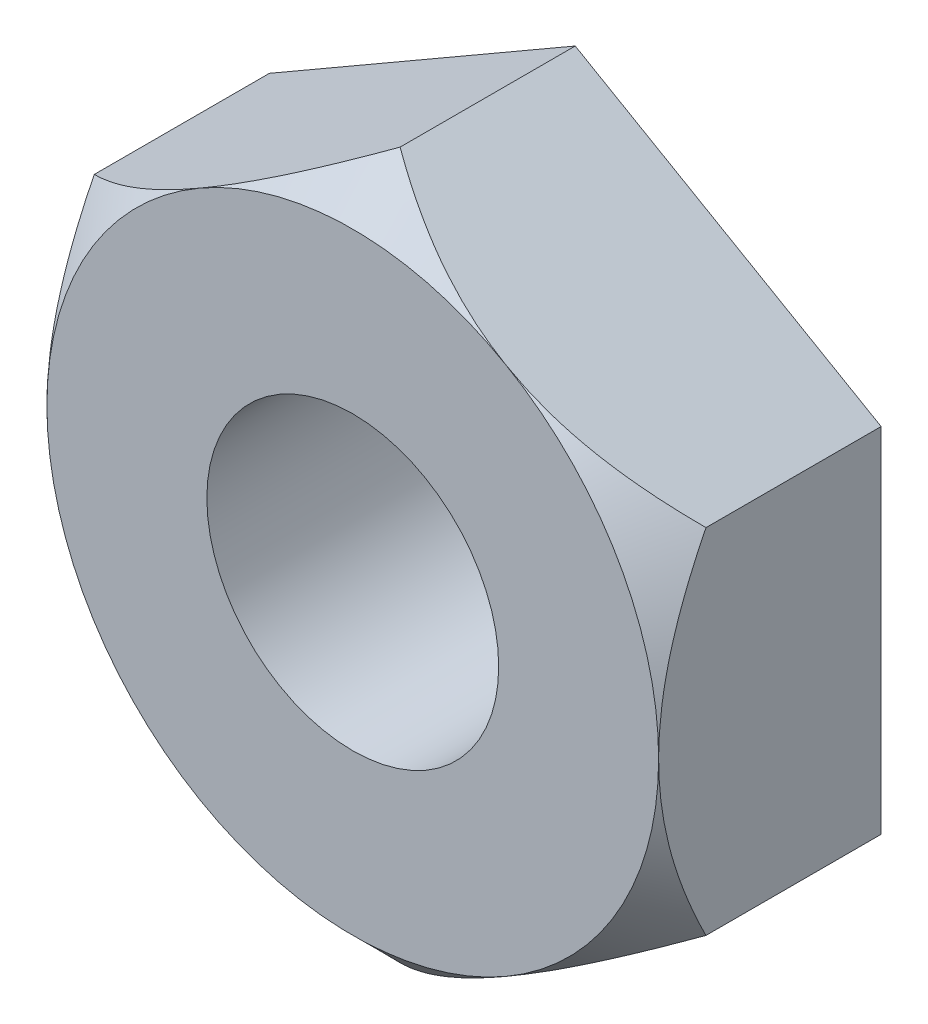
ISO-10303-21;
HEADER;
FILE_DESCRIPTION(('STEP AP214'),'2;1');
FILE_NAME('part.step','',(''),(''),'','','');
FILE_SCHEMA(('AUTOMOTIVE_DESIGN { 1 0 10303 214 1 1 1 1 }'));
ENDSEC;
DATA;
#1=APPLICATION_CONTEXT('core data for automotive mechanical design processes');
#2=APPLICATION_PROTOCOL_DEFINITION('international standard','automotive_design',2000,#1);
#3=PRODUCT_CONTEXT('',#1,'mechanical');
#4=PRODUCT('Part','Part','',(#3));
#5=PRODUCT_RELATED_PRODUCT_CATEGORY('part','',(#4));
#6=PRODUCT_DEFINITION_FORMATION('','',#4);
#7=PRODUCT_DEFINITION_CONTEXT('part definition',#1,'design');
#8=PRODUCT_DEFINITION('design','',#6,#7);
#9=PRODUCT_DEFINITION_SHAPE('','',#8);
#10=(LENGTH_UNIT() NAMED_UNIT(*) SI_UNIT(.MILLI.,.METRE.));
#11=(NAMED_UNIT(*) PLANE_ANGLE_UNIT() SI_UNIT($,.RADIAN.));
#12=(NAMED_UNIT(*) SI_UNIT($,.STERADIAN.) SOLID_ANGLE_UNIT());
#13=UNCERTAINTY_MEASURE_WITH_UNIT(LENGTH_MEASURE(1.E-05),#10,'distance_accuracy_value','');
#14=(GEOMETRIC_REPRESENTATION_CONTEXT(3) GLOBAL_UNCERTAINTY_ASSIGNED_CONTEXT((#13)) GLOBAL_UNIT_ASSIGNED_CONTEXT((#10,
#11,#12)) REPRESENTATION_CONTEXT('',''));
#15=CARTESIAN_POINT('',(0.,0.,0.));
#16=DIRECTION('',(0.,0.,1.));
#17=DIRECTION('',(1.,0.,0.));
#18=AXIS2_PLACEMENT_3D('',#15,#16,#17);
#19=CARTESIAN_POINT('',(0.,5.04098953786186,3.175));
#20=DIRECTION('',(0.,0.,1.));
#21=DIRECTION('',(1.,0.,0.));
#22=AXIS2_PLACEMENT_3D('',#19,#20,#21);
#23=PLANE('',#22);
#24=CARTESIAN_POINT('',(0.,0.,3.17500000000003));
#25=DIRECTION('',(0.,0.,1.));
#26=DIRECTION('',(1.,0.,0.));
#27=AXIS2_PLACEMENT_3D('',#24,#25,#26);
#28=CIRCLE('',#27,4.365625);
#29=CARTESIAN_POINT('',(2.18281249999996,-3.78074215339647,3.175));
#30=VERTEX_POINT('',#29);
#31=CARTESIAN_POINT('',(4.36562499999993,0.,3.175));
#32=VERTEX_POINT('',#31);
#33=EDGE_CURVE('E128',#30,#32,#28,.T.);
#34=ORIENTED_EDGE('',*,*,#33,.T.);
#35=CARTESIAN_POINT('',(2.18281249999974,3.78074215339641,3.17499999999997));
#36=VERTEX_POINT('',#35);
#37=EDGE_CURVE('E111',#32,#36,#28,.T.);
#38=ORIENTED_EDGE('',*,*,#37,.T.);
#39=CARTESIAN_POINT('',(-2.18281249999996,3.78074215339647,3.17500000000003));
#40=VERTEX_POINT('',#39);
#41=EDGE_CURVE('E102',#36,#40,#28,.T.);
#42=ORIENTED_EDGE('',*,*,#41,.T.);
#43=CARTESIAN_POINT('',(-4.36562499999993,0.,3.175));
#44=VERTEX_POINT('',#43);
#45=EDGE_CURVE('E112',#40,#44,#28,.T.);
#46=ORIENTED_EDGE('',*,*,#45,.T.);
#47=CARTESIAN_POINT('',(-2.18281249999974,-3.78074215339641,3.17500000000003));
#48=VERTEX_POINT('',#47);
#49=EDGE_CURVE('E45',#44,#48,#28,.T.);
#50=ORIENTED_EDGE('',*,*,#49,.T.);
#51=EDGE_CURVE('E53',#48,#30,#28,.T.);
#52=ORIENTED_EDGE('',*,*,#51,.T.);
#53=EDGE_LOOP('',(#34,#38,#42,#46,#50,#52));
#54=FACE_BOUND('',#53,.T.);
#55=CARTESIAN_POINT('',(0.,0.,3.17500000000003));
#56=DIRECTION('',(0.,0.,1.));
#57=DIRECTION('',(1.,0.,0.));
#58=AXIS2_PLACEMENT_3D('',#55,#56,#57);
#59=CIRCLE('',#58,2.0828);
#60=CARTESIAN_POINT('',(2.0828,0.,3.17500000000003));
#61=VERTEX_POINT('',#60);
#62=EDGE_CURVE('E228',#61,#61,#59,.T.);
#63=ORIENTED_EDGE('',*,*,#62,.F.);
#64=EDGE_LOOP('',(#63));
#65=FACE_BOUND('',#64,.T.);
#66=ADVANCED_FACE('F24',(#54,#65),#23,.T.);
#67=CARTESIAN_POINT('',(0.,5.04098953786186,0.));
#68=DIRECTION('',(0.,0.,1.));
#69=DIRECTION('',(1.,0.,0.));
#70=AXIS2_PLACEMENT_3D('',#67,#68,#69);
#71=PLANE('',#70);
#72=DIRECTION('',(-0.866025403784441,-0.500000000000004,0.));
#73=VECTOR('',#72,1.);
#74=CARTESIAN_POINT('',(0.,5.04098953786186,0.));
#75=LINE('',#74,#73);
#76=CARTESIAN_POINT('',(0.,5.04098953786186,0.));
#77=VERTEX_POINT('',#76);
#78=CARTESIAN_POINT('',(-4.36562500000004,2.5204947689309,0.));
#79=VERTEX_POINT('',#78);
#80=EDGE_CURVE('E223',#77,#79,#75,.T.);
#81=ORIENTED_EDGE('',*,*,#80,.F.);
#82=DIRECTION('',(0.866025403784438,-0.5,0.));
#83=VECTOR('',#82,1.);
#84=CARTESIAN_POINT('',(0.,5.04098953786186,0.));
#85=LINE('',#84,#83);
#86=CARTESIAN_POINT('',(4.36562500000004,2.52049476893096,0.));
#87=VERTEX_POINT('',#86);
#88=EDGE_CURVE('E209',#77,#87,#85,.T.);
#89=ORIENTED_EDGE('',*,*,#88,.T.);
#90=DIRECTION('',(0.,-1.,0.));
#91=VECTOR('',#90,1.);
#92=CARTESIAN_POINT('',(4.36562500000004,2.52049476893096,0.));
#93=LINE('',#92,#91);
#94=CARTESIAN_POINT('',(4.36562499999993,-2.52049476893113,0.));
#95=VERTEX_POINT('',#94);
#96=EDGE_CURVE('E204',#87,#95,#93,.T.);
#97=ORIENTED_EDGE('',*,*,#96,.T.);
#98=DIRECTION('',(0.866025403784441,0.500000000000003,0.));
#99=VECTOR('',#98,1.);
#100=CARTESIAN_POINT('',(0.,-5.04098953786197,0.));
#101=LINE('',#100,#99);
#102=CARTESIAN_POINT('',(0.,-5.04098953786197,0.));
#103=VERTEX_POINT('',#102);
#104=EDGE_CURVE('E233',#103,#95,#101,.T.);
#105=ORIENTED_EDGE('',*,*,#104,.F.);
#106=DIRECTION('',(-0.866025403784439,0.5,0.));
#107=VECTOR('',#106,1.);
#108=CARTESIAN_POINT('',(0.,-5.04098953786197,0.));
#109=LINE('',#108,#107);
#110=CARTESIAN_POINT('',(-4.36562500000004,-2.52049476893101,0.));
#111=VERTEX_POINT('',#110);
#112=EDGE_CURVE('E226',#103,#111,#109,.T.);
#113=ORIENTED_EDGE('',*,*,#112,.T.);
#114=DIRECTION('',(0.,-1.,0.));
#115=VECTOR('',#114,1.);
#116=CARTESIAN_POINT('',(-4.36562500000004,2.5204947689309,0.));
#117=LINE('',#116,#115);
#118=EDGE_CURVE('E215',#79,#111,#117,.T.);
#119=ORIENTED_EDGE('',*,*,#118,.F.);
#120=EDGE_LOOP('',(#81,#89,#97,#105,#113,#119));
#121=FACE_BOUND('',#120,.T.);
#122=CARTESIAN_POINT('',(0.,0.,0.));
#123=DIRECTION('',(0.,0.,1.));
#124=DIRECTION('',(1.,0.,0.));
#125=AXIS2_PLACEMENT_3D('',#122,#123,#124);
#126=CIRCLE('',#125,2.0828);
#127=CARTESIAN_POINT('',(2.0828,0.,0.));
#128=VERTEX_POINT('',#127);
#129=EDGE_CURVE('E139',#128,#128,#126,.T.);
#130=ORIENTED_EDGE('',*,*,#129,.T.);
#131=EDGE_LOOP('',(#130));
#132=FACE_BOUND('',#131,.T.);
#133=ADVANCED_FACE('F221',(#121,#132),#71,.F.);
#134=CARTESIAN_POINT('',(0.,5.04098953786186,3.175));
#135=DIRECTION('',(0.5,-0.86602540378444,0.));
#136=DIRECTION('',(0.866025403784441,0.500000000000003,0.));
#137=AXIS2_PLACEMENT_3D('',#134,#135,#136);
#138=PLANE('',#137);
#139=CARTESIAN_POINT('',(0.000200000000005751,5.0411050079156,2.49951998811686));
#140=CARTESIAN_POINT('',(-0.0748657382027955,4.99776578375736,2.54285568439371));
#141=CARTESIAN_POINT('',(-0.150508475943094,4.95409342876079,2.58486150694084));
#142=CARTESIAN_POINT('',(-0.303061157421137,4.86601709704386,2.66580884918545));
#143=CARTESIAN_POINT('',(-0.379971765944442,4.82161273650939,2.704748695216));
#144=CARTESIAN_POINT('',(-0.613489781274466,4.68679104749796,2.81669452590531));
#145=CARTESIAN_POINT('',(-0.772074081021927,4.59523235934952,2.88434920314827));
#146=CARTESIAN_POINT('',(-1.09187204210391,4.41059692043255,3.00020333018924));
#147=CARTESIAN_POINT('',(-1.2530039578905,4.31756736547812,3.04869466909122));
#148=CARTESIAN_POINT('',(-1.49735101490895,4.17649352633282,3.10478734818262));
#149=CARTESIAN_POINT('',(-1.5791597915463,4.12926120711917,3.12070335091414));
#150=CARTESIAN_POINT('',(-1.74347006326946,4.03439662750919,3.14662706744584));
#151=CARTESIAN_POINT('',(-1.82597145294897,3.98676442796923,3.1566356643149));
#152=CARTESIAN_POINT('',(-2.02701302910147,3.87069301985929,3.17341632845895));
#153=CARTESIAN_POINT('',(-2.14576982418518,3.80212875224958,3.17693743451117));
#154=CARTESIAN_POINT('',(-2.38306940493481,3.66512377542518,3.17102881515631));
#155=CARTESIAN_POINT('',(-2.50161210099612,3.59668311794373,3.1615945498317));
#156=CARTESIAN_POINT('',(-2.73757992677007,3.46044703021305,3.13033130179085));
#157=CARTESIAN_POINT('',(-2.85500365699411,3.39265240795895,3.10848845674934));
#158=CARTESIAN_POINT('',(-3.08783290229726,3.25822838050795,3.05359557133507));
#159=CARTESIAN_POINT('',(-3.20323857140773,3.19159888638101,3.02054639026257));
#160=CARTESIAN_POINT('',(-3.40811000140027,3.07331631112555,2.95255207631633));
#161=CARTESIAN_POINT('',(-3.49802929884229,3.02140138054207,2.91939475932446));
#162=CARTESIAN_POINT('',(-3.6762536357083,2.91850351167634,2.84773661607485));
#163=CARTESIAN_POINT('',(-3.76455862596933,2.86752060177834,2.80923562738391));
#164=CARTESIAN_POINT('',(-3.9392762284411,2.7666473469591,2.7277532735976));
#165=CARTESIAN_POINT('',(-4.02569380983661,2.71675413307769,2.68478599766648));
#166=CARTESIAN_POINT('',(-4.1969286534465,2.61789165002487,2.59493525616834));
#167=CARTESIAN_POINT('',(-4.28174685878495,2.56892183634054,2.54805419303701));
#168=CARTESIAN_POINT('',(-4.36582499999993,2.52037929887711,2.49951998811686));
#169=B_SPLINE_CURVE_WITH_KNOTS('',3,(#139,#140,#141,#142,#143,#144,#145,#146,#147,#148,#149,
#150,#151,#152,#153,#154,#155,#156,#157,#158,#159,#160,#161,#162,#163,#164,#165,#166,#167,#168),
.UNSPECIFIED.,.F.,.F.,(4,2,2,2,2,2,2,2,2,2,2,2,2,2,4),(0.,0.290706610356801,0.58157082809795,
1.16643976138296,1.74202094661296,2.02924700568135,2.31643011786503,2.72731191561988,
3.13833773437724,3.54982363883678,3.96127799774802,4.28811145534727,4.61495484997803,
4.9407968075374,5.26644020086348),.UNSPECIFIED.);
#170=CARTESIAN_POINT('',(0.,5.04098953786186,2.49963546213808));
#171=VERTEX_POINT('',#170);
#172=EDGE_CURVE('E106',#171,#40,#169,.T.);
#173=ORIENTED_EDGE('',*,*,#172,.F.);
#174=DIRECTION('',(0.,0.,-1.));
#175=VECTOR('',#174,1.);
#176=CARTESIAN_POINT('',(0.,5.04098953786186,3.175));
#177=LINE('',#176,#175);
#178=EDGE_CURVE('E126',#171,#77,#177,.T.);
#179=ORIENTED_EDGE('',*,*,#178,.T.);
#180=ORIENTED_EDGE('',*,*,#80,.T.);
#181=DIRECTION('',(0.,0.,-1.));
#182=VECTOR('',#181,1.);
#183=CARTESIAN_POINT('',(-4.36562500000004,2.5204947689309,3.175));
#184=LINE('',#183,#182);
#185=CARTESIAN_POINT('',(-4.36562500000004,2.5204947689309,2.49963546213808));
#186=VERTEX_POINT('',#185);
#187=EDGE_CURVE('E122',#186,#79,#184,.T.);
#188=ORIENTED_EDGE('',*,*,#187,.F.);
#189=EDGE_CURVE('E133',#40,#186,#169,.T.);
#190=ORIENTED_EDGE('',*,*,#189,.F.);
#191=EDGE_LOOP('',(#173,#179,#180,#188,#190));
#192=FACE_BOUND('',#191,.T.);
#193=ADVANCED_FACE('F26',(#192),#138,.F.);
#194=CARTESIAN_POINT('',(-4.36562500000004,2.5204947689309,3.175));
#195=DIRECTION('',(1.,0.,0.));
#196=DIRECTION('',(0.,1.,0.));
#197=AXIS2_PLACEMENT_3D('',#194,#195,#196);
#198=PLANE('',#197);
#199=CARTESIAN_POINT('',(-4.36562500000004,-6.45523378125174,-0.252238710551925));
#200=CARTESIAN_POINT('',(-4.36562500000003,-6.29278793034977,-0.117710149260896));
#201=CARTESIAN_POINT('',(-4.36562500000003,-6.12958412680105,0.015917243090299));
#202=CARTESIAN_POINT('',(-4.36562500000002,-5.80126519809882,0.280885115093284));
#203=CARTESIAN_POINT('',(-4.36562500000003,-5.63614960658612,0.412225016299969));
#204=CARTESIAN_POINT('',(-4.36562500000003,-5.30184889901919,0.673506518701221));
#205=CARTESIAN_POINT('',(-4.36562500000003,-5.13263895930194,0.803416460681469));
#206=CARTESIAN_POINT('',(-4.36562500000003,-4.79147665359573,1.05955841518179));
#207=CARTESIAN_POINT('',(-4.36562500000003,-4.61952456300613,1.18579079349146));
#208=CARTESIAN_POINT('',(-4.36562500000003,-4.25495675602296,1.44592135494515));
#209=CARTESIAN_POINT('',(-4.36562500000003,-4.06198957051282,1.5793297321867));
#210=CARTESIAN_POINT('',(-4.36562500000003,-3.67092314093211,1.83861603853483));
#211=CARTESIAN_POINT('',(-4.36562500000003,-3.4728221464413,1.96449134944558));
#212=CARTESIAN_POINT('',(-4.36562500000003,-3.07128678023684,2.20529276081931));
#213=CARTESIAN_POINT('',(-4.36562500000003,-2.86788198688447,2.32026772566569));
#214=CARTESIAN_POINT('',(-4.36562500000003,-2.45366201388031,2.53583889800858));
#215=CARTESIAN_POINT('',(-4.36562500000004,-2.24285377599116,2.63644814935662));
#216=CARTESIAN_POINT('',(-4.36562500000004,-1.87793051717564,2.79016332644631));
#217=CARTESIAN_POINT('',(-4.36562500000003,-1.72600254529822,2.84842383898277));
#218=CARTESIAN_POINT('',(-4.36562500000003,-1.41793250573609,2.9527909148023));
#219=CARTESIAN_POINT('',(-4.36562500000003,-1.26178987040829,2.99889583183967));
#220=CARTESIAN_POINT('',(-4.36562500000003,-0.949462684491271,3.07544845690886));
#221=CARTESIAN_POINT('',(-4.36562500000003,-0.793362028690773,3.10623251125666));
#222=CARTESIAN_POINT('',(-4.36562500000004,-0.47880551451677,3.15157503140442));
#223=CARTESIAN_POINT('',(-4.36562500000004,-0.320350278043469,3.16613770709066));
#224=CARTESIAN_POINT('',(-4.36562500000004,-0.0118154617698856,3.17755082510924));
#225=CARTESIAN_POINT('',(-4.36562500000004,0.138228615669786,3.17536038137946));
#226=CARTESIAN_POINT('',(-4.36562500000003,0.437301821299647,3.15569180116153));
#227=CARTESIAN_POINT('',(-4.36562500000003,0.586330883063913,3.13821267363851));
#228=CARTESIAN_POINT('',(-4.36562500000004,0.884907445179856,3.08870168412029));
#229=CARTESIAN_POINT('',(-4.36562500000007,1.03440793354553,3.05639150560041));
#230=CARTESIAN_POINT('',(-4.36562500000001,1.33004425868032,2.97912133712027));
#231=CARTESIAN_POINT('',(-4.36562499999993,1.47618010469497,2.93416138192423));
#232=CARTESIAN_POINT('',(-4.36562499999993,1.76651347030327,2.83313215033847));
#233=CARTESIAN_POINT('',(-4.36562500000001,1.91066549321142,2.77693385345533));
#234=CARTESIAN_POINT('',(-4.36562500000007,2.19528951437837,2.65581403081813));
#235=CARTESIAN_POINT('',(-4.36562500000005,2.33575988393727,2.59088871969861));
#236=CARTESIAN_POINT('',(-4.36562500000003,2.61366128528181,2.45385310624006));
#237=CARTESIAN_POINT('',(-4.36562500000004,2.75108160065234,2.38172125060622));
#238=CARTESIAN_POINT('',(-4.36562500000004,3.02278423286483,2.2318521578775));
#239=CARTESIAN_POINT('',(-4.36562500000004,3.15706701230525,2.15411575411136));
#240=CARTESIAN_POINT('',(-4.36562500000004,3.41632658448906,1.99808113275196));
#241=CARTESIAN_POINT('',(-4.36562500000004,3.54143519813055,1.92000078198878));
#242=CARTESIAN_POINT('',(-4.36562500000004,3.78950266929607,1.76048711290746));
#243=CARTESIAN_POINT('',(-4.36562500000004,3.91246136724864,1.67905354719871));
#244=CARTESIAN_POINT('',(-4.36562500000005,4.1555325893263,1.51408252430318));
#245=CARTESIAN_POINT('',(-4.36562500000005,4.27565994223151,1.43056683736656));
#246=CARTESIAN_POINT('',(-4.36562500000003,4.51426249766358,1.26127385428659));
#247=CARTESIAN_POINT('',(-4.365625,4.63273814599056,1.17549718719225));
#248=CARTESIAN_POINT('',(-4.36562499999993,4.75051992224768,1.08879416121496));
#249=B_SPLINE_CURVE_WITH_KNOTS('',3,(#199,#200,#201,#202,#203,#204,#205,#206,#207,#208,#209,
#210,#211,#212,#213,#214,#215,#216,#217,#218,#219,#220,#221,#222,#223,#224,#225,#226,#227,#228,
#229,#230,#231,#232,#233,#234,#235,#236,#237,#238,#239,#240,#241,#242,#243,#244,#245,#246,#247,
#248),.UNSPECIFIED.,.F.,.F.,(4,2,2,2,2,2,2,2,2,2,2,2,2,2,2,2,2,2,2,2,2,2,2,2,4),(0.,
0.632765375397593,1.26568850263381,1.90563057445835,2.54550877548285,3.24915816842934,
3.95305071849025,4.65362173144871,5.35355253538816,5.84129599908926,6.32910548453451,
6.80567300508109,7.28211681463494,7.73149737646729,8.18090706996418,8.63911863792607,
9.09732894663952,9.5611375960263,10.0251480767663,10.4905904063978,10.9559636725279,
11.3983244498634,11.8407179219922,12.2796077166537,12.7183766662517),.UNSPECIFIED.);
#250=EDGE_CURVE('E135',#186,#44,#249,.F.);
#251=ORIENTED_EDGE('',*,*,#250,.F.);
#252=ORIENTED_EDGE('',*,*,#187,.T.);
#253=ORIENTED_EDGE('',*,*,#118,.T.);
#254=DIRECTION('',(0.,0.,-1.));
#255=VECTOR('',#254,1.);
#256=CARTESIAN_POINT('',(-4.36562500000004,-2.52049476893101,3.175));
#257=LINE('',#256,#255);
#258=CARTESIAN_POINT('',(-4.36562500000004,-2.52049476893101,2.49963546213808));
#259=VERTEX_POINT('',#258);
#260=EDGE_CURVE('E145',#259,#111,#257,.T.);
#261=ORIENTED_EDGE('',*,*,#260,.F.);
#262=EDGE_CURVE('E140',#44,#259,#249,.F.);
#263=ORIENTED_EDGE('',*,*,#262,.F.);
#264=EDGE_LOOP('',(#251,#252,#253,#261,#263));
#265=FACE_BOUND('',#264,.T.);
#266=ADVANCED_FACE('F143',(#265),#198,.F.);
#267=CARTESIAN_POINT('',(0.,-5.04098953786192,3.175));
#268=DIRECTION('',(-0.500000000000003,-0.866025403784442,0.));
#269=DIRECTION('',(0.866025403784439,-0.5,0.));
#270=AXIS2_PLACEMENT_3D('',#267,#268,#269);
#271=PLANE('',#270);
#272=DIRECTION('',(0.,0.,-1.));
#273=VECTOR('',#272,1.);
#274=CARTESIAN_POINT('',(0.,-5.04098953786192,3.175));
#275=LINE('',#274,#273);
#276=CARTESIAN_POINT('',(0.,-5.04098953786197,2.49963546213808));
#277=VERTEX_POINT('',#276);
#278=EDGE_CURVE('E207',#277,#103,#275,.T.);
#279=ORIENTED_EDGE('',*,*,#278,.F.);
#280=CARTESIAN_POINT('',(0.000200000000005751,-5.04110500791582,2.49951998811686));
#281=CARTESIAN_POINT('',(-0.074865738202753,-4.9977657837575,2.54285568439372));
#282=CARTESIAN_POINT('',(-0.150508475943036,-4.95409342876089,2.58486150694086));
#283=CARTESIAN_POINT('',(-0.303061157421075,-4.86601709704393,2.66580884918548));
#284=CARTESIAN_POINT('',(-0.379971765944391,-4.82161273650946,2.70474869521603));
#285=CARTESIAN_POINT('',(-0.613489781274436,-4.68679104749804,2.81669452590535));
#286=CARTESIAN_POINT('',(-0.772074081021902,-4.59523235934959,2.88434920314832));
#287=CARTESIAN_POINT('',(-1.09187204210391,-4.4105969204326,3.00020333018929));
#288=CARTESIAN_POINT('',(-1.25300395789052,-4.31756736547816,3.04869466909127));
#289=CARTESIAN_POINT('',(-1.497351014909,-4.17649352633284,3.10478734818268));
#290=CARTESIAN_POINT('',(-1.57915979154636,-4.12926120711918,3.12070335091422));
#291=CARTESIAN_POINT('',(-1.74347006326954,-4.0343966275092,3.14662706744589));
#292=CARTESIAN_POINT('',(-1.82597145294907,-3.98676442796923,3.15663566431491));
#293=CARTESIAN_POINT('',(-2.0270130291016,-3.87069301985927,3.17341632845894));
#294=CARTESIAN_POINT('',(-2.14576982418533,-3.80212875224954,3.1769374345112));
#295=CARTESIAN_POINT('',(-2.38306940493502,-3.66512377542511,3.17102881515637));
#296=CARTESIAN_POINT('',(-2.50161210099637,-3.59668311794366,3.16159454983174));
#297=CARTESIAN_POINT('',(-2.73757992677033,-3.46044703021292,3.13033130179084));
#298=CARTESIAN_POINT('',(-2.85500365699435,-3.39265240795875,3.1084884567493));
#299=CARTESIAN_POINT('',(-3.08783290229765,-3.25822838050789,3.05359557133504));
#300=CARTESIAN_POINT('',(-3.20323857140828,-3.19159888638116,3.02054639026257));
#301=CARTESIAN_POINT('',(-3.40811000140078,-3.07331631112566,2.9525520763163));
#302=CARTESIAN_POINT('',(-3.49802929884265,-3.02140138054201,2.91939475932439));
#303=CARTESIAN_POINT('',(-3.6762536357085,-2.91850351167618,2.84773661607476));
#304=CARTESIAN_POINT('',(-3.76455862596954,-2.86752060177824,2.80923562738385));
#305=CARTESIAN_POINT('',(-3.93927622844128,-2.76664734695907,2.72775327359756));
#306=CARTESIAN_POINT('',(-4.02569380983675,-2.71675413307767,2.68478599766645));
#307=CARTESIAN_POINT('',(-4.19692865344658,-2.61789165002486,2.59493525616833));
#308=CARTESIAN_POINT('',(-4.28174685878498,-2.56892183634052,2.54805419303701));
#309=CARTESIAN_POINT('',(-4.36582499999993,-2.52037929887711,2.49951998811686));
#310=B_SPLINE_CURVE_WITH_KNOTS('',3,(#280,#281,#282,#283,#284,#285,#286,#287,#288,#289,#290,
#291,#292,#293,#294,#295,#296,#297,#298,#299,#300,#301,#302,#303,#304,#305,#306,#307,#308,#309),
.UNSPECIFIED.,.F.,.F.,(4,2,2,2,2,2,2,2,2,2,2,2,2,2,4),(0.,0.290706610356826,0.581570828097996,
1.16643976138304,1.7420209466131,2.02924700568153,2.31643011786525,2.72731191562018,
3.13833773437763,3.54982363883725,3.96127799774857,4.28811145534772,4.61495484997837,
4.94079680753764,5.26644020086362),.UNSPECIFIED.);
#311=EDGE_CURVE('E149',#277,#48,#310,.T.);
#312=ORIENTED_EDGE('',*,*,#311,.T.);
#313=EDGE_CURVE('E147',#48,#259,#310,.T.);
#314=ORIENTED_EDGE('',*,*,#313,.T.);
#315=ORIENTED_EDGE('',*,*,#260,.T.);
#316=ORIENTED_EDGE('',*,*,#112,.F.);
#317=EDGE_LOOP('',(#279,#312,#314,#315,#316));
#318=FACE_BOUND('',#317,.T.);
#319=ADVANCED_FACE('F164',(#318),#271,.T.);
#320=CARTESIAN_POINT('',(0.,-5.04098953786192,3.175));
#321=DIRECTION('',(-0.5,0.86602540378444,0.));
#322=DIRECTION('',(-0.866025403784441,-0.500000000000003,0.));
#323=AXIS2_PLACEMENT_3D('',#320,#321,#322);
#324=PLANE('',#323);
#325=CARTESIAN_POINT('',(-0.000200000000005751,-5.04110500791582,2.49951998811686));
#326=CARTESIAN_POINT('',(0.0748657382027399,-4.99776578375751,2.54285568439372));
#327=CARTESIAN_POINT('',(0.150508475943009,-4.95409342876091,2.58486150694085));
#328=CARTESIAN_POINT('',(0.30306115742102,-4.86601709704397,2.66580884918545));
#329=CARTESIAN_POINT('',(0.379971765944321,-4.8216127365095,2.70474869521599));
#330=CARTESIAN_POINT('',(0.61348978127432,-4.68679104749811,2.8166945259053));
#331=CARTESIAN_POINT('',(0.772074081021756,-4.59523235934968,2.88434920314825));
#332=CARTESIAN_POINT('',(1.09187204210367,-4.41059692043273,3.00020333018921));
#333=CARTESIAN_POINT('',(1.25300395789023,-4.3175673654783,3.04869466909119));
#334=CARTESIAN_POINT('',(1.49735101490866,-4.17649352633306,3.10478734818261));
#335=CARTESIAN_POINT('',(1.57915979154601,-4.12926120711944,3.12070335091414));
#336=CARTESIAN_POINT('',(1.74347006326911,-4.03439662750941,3.14662706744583));
#337=CARTESIAN_POINT('',(1.82597145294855,-3.98676442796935,3.15663566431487));
#338=CARTESIAN_POINT('',(2.02701302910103,-3.87069301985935,3.17341632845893));
#339=CARTESIAN_POINT('',(2.14576982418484,-3.80212875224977,3.1769374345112));
#340=CARTESIAN_POINT('',(2.38306940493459,-3.66512377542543,3.17102881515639));
#341=CARTESIAN_POINT('',(2.5016121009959,-3.59668311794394,3.16159454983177));
#342=CARTESIAN_POINT('',(2.73757992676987,-3.46044703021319,3.13033130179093));
#343=CARTESIAN_POINT('',(2.85500365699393,-3.39265240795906,3.10848845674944));
#344=CARTESIAN_POINT('',(3.08783290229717,-3.25822838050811,3.0535955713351));
#345=CARTESIAN_POINT('',(3.2032385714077,-3.19159888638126,3.02054639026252));
#346=CARTESIAN_POINT('',(3.40811000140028,-3.07331631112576,2.95255207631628));
#347=CARTESIAN_POINT('',(3.49802929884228,-3.02140138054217,2.91939475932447));
#348=CARTESIAN_POINT('',(3.67625363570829,-2.91850351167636,2.8477366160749));
#349=CARTESIAN_POINT('',(3.76455862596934,-2.86752060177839,2.80923562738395));
#350=CARTESIAN_POINT('',(3.93927622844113,-2.76664734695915,2.72775327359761));
#351=CARTESIAN_POINT('',(4.02569380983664,-2.71675413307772,2.68478599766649));
#352=CARTESIAN_POINT('',(4.19692865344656,-2.61789165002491,2.59493525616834));
#353=CARTESIAN_POINT('',(4.28174685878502,-2.56892183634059,2.54805419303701));
#354=CARTESIAN_POINT('',(4.36582500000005,-2.52037929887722,2.49951998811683));
#355=B_SPLINE_CURVE_WITH_KNOTS('',3,(#325,#326,#327,#328,#329,#330,#331,#332,#333,#334,#335,
#336,#337,#338,#339,#340,#341,#342,#343,#344,#345,#346,#347,#348,#349,#350,#351,#352,#353,#354),
.UNSPECIFIED.,.F.,.F.,(4,2,2,2,2,2,2,2,2,2,2,2,2,2,4),(0.,0.290706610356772,0.58157082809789,
1.16643976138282,1.74202094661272,2.02924700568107,2.31643011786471,2.72731191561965,
3.13833773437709,3.54982363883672,3.96127799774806,4.28811145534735,4.61495484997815,
4.94079680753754,5.26644020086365),.UNSPECIFIED.);
#356=EDGE_CURVE('E181',#277,#30,#355,.T.);
#357=ORIENTED_EDGE('',*,*,#356,.F.);
#358=ORIENTED_EDGE('',*,*,#278,.T.);
#359=ORIENTED_EDGE('',*,*,#104,.T.);
#360=DIRECTION('',(0.,0.,-1.));
#361=VECTOR('',#360,1.);
#362=CARTESIAN_POINT('',(4.36562500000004,-2.52049476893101,3.17499999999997));
#363=LINE('',#362,#361);
#364=CARTESIAN_POINT('',(4.36562500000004,-2.52049476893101,2.49963546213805));
#365=VERTEX_POINT('',#364);
#366=EDGE_CURVE('E196',#365,#95,#363,.T.);
#367=ORIENTED_EDGE('',*,*,#366,.F.);
#368=EDGE_CURVE('E176',#30,#365,#355,.T.);
#369=ORIENTED_EDGE('',*,*,#368,.F.);
#370=EDGE_LOOP('',(#357,#358,#359,#367,#369));
#371=FACE_BOUND('',#370,.T.);
#372=ADVANCED_FACE('F168',(#371),#324,.F.);
#373=CARTESIAN_POINT('',(4.36562500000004,2.52049476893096,3.175));
#374=DIRECTION('',(1.,0.,0.));
#375=DIRECTION('',(0.,1.,0.));
#376=AXIS2_PLACEMENT_3D('',#373,#374,#375);
#377=PLANE('',#376);
#378=DIRECTION('',(0.,0.,-1.));
#379=VECTOR('',#378,1.);
#380=CARTESIAN_POINT('',(4.36562500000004,2.52049476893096,3.175));
#381=LINE('',#380,#379);
#382=CARTESIAN_POINT('',(4.36562500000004,2.52049476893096,2.49963546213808));
#383=VERTEX_POINT('',#382);
#384=EDGE_CURVE('E202',#383,#87,#381,.T.);
#385=ORIENTED_EDGE('',*,*,#384,.F.);
#386=CARTESIAN_POINT('',(4.36562500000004,-6.4552337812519,-0.252238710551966));
#387=CARTESIAN_POINT('',(4.36562500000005,-6.2927879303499,-0.11771014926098));
#388=CARTESIAN_POINT('',(4.36562500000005,-6.12958412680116,0.0159172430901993));
#389=CARTESIAN_POINT('',(4.36562500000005,-5.80126519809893,0.280885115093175));
#390=CARTESIAN_POINT('',(4.36562500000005,-5.63614960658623,0.412225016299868));
#391=CARTESIAN_POINT('',(4.36562500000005,-5.3018488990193,0.673506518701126));
#392=CARTESIAN_POINT('',(4.36562500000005,-5.13263895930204,0.803416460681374));
#393=CARTESIAN_POINT('',(4.36562500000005,-4.79147665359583,1.0595584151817));
#394=CARTESIAN_POINT('',(4.36562500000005,-4.61952456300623,1.18579079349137));
#395=CARTESIAN_POINT('',(4.36562500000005,-4.25495675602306,1.44592135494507));
#396=CARTESIAN_POINT('',(4.36562500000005,-4.06198957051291,1.57932973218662));
#397=CARTESIAN_POINT('',(4.36562500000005,-3.67092314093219,1.83861603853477));
#398=CARTESIAN_POINT('',(4.36562500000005,-3.47282214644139,1.96449134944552));
#399=CARTESIAN_POINT('',(4.36562500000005,-3.07128678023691,2.20529276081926));
#400=CARTESIAN_POINT('',(4.36562500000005,-2.86788198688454,2.32026772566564));
#401=CARTESIAN_POINT('',(4.36562500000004,-2.45366201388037,2.53583889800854));
#402=CARTESIAN_POINT('',(4.36562500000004,-2.24285377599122,2.63644814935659));
#403=CARTESIAN_POINT('',(4.36562500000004,-1.87793051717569,2.79016332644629));
#404=CARTESIAN_POINT('',(4.36562500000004,-1.72600254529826,2.84842383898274));
#405=CARTESIAN_POINT('',(4.36562500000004,-1.41793250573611,2.95279091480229));
#406=CARTESIAN_POINT('',(4.36562500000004,-1.2617898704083,2.99889583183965));
#407=CARTESIAN_POINT('',(4.36562500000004,-0.949462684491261,3.07544845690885));
#408=CARTESIAN_POINT('',(4.36562500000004,-0.793362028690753,3.10623251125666));
#409=CARTESIAN_POINT('',(4.36562500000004,-0.478805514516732,3.15157503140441));
#410=CARTESIAN_POINT('',(4.36562500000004,-0.320350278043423,3.16613770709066));
#411=CARTESIAN_POINT('',(4.36562500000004,-0.0118154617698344,3.17755082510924));
#412=CARTESIAN_POINT('',(4.36562500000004,0.138228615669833,3.17536038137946));
#413=CARTESIAN_POINT('',(4.36562500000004,0.437301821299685,3.15569180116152));
#414=CARTESIAN_POINT('',(4.36562500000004,0.586330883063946,3.1382126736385));
#415=CARTESIAN_POINT('',(4.36562500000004,0.884907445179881,3.08870168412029));
#416=CARTESIAN_POINT('',(4.36562500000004,1.03440793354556,3.05639150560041));
#417=CARTESIAN_POINT('',(4.36562500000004,1.33004425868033,2.97912133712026));
#418=CARTESIAN_POINT('',(4.36562500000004,1.47618010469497,2.9341613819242));
#419=CARTESIAN_POINT('',(4.36562500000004,1.76651347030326,2.83313215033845));
#420=CARTESIAN_POINT('',(4.36562500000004,1.91066549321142,2.77693385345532));
#421=CARTESIAN_POINT('',(4.36562500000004,2.19528951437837,2.65581403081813));
#422=CARTESIAN_POINT('',(4.36562500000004,2.33575988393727,2.59088871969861));
#423=CARTESIAN_POINT('',(4.36562500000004,2.6136612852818,2.45385310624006));
#424=CARTESIAN_POINT('',(4.36562500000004,2.75108160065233,2.38172125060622));
#425=CARTESIAN_POINT('',(4.36562500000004,3.02278423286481,2.23185215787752));
#426=CARTESIAN_POINT('',(4.36562500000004,3.15706701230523,2.15411575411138));
#427=CARTESIAN_POINT('',(4.36562500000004,3.41632658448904,1.99808113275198));
#428=CARTESIAN_POINT('',(4.36562500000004,3.54143519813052,1.9200007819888));
#429=CARTESIAN_POINT('',(4.36562500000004,3.78950266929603,1.76048711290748));
#430=CARTESIAN_POINT('',(4.36562500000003,3.9124613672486,1.67905354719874));
#431=CARTESIAN_POINT('',(4.36562500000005,4.15553258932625,1.51408252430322));
#432=CARTESIAN_POINT('',(4.36562500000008,4.27565994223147,1.43056683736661));
#433=CARTESIAN_POINT('',(4.365625,4.51426249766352,1.26127385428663));
#434=CARTESIAN_POINT('',(4.36562499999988,4.63273814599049,1.17549718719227));
#435=CARTESIAN_POINT('',(4.3656249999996,4.75051992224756,1.08879416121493));
#436=B_SPLINE_CURVE_WITH_KNOTS('',3,(#386,#387,#388,#389,#390,#391,#392,#393,#394,#395,#396,
#397,#398,#399,#400,#401,#402,#403,#404,#405,#406,#407,#408,#409,#410,#411,#412,#413,#414,#415,
#416,#417,#418,#419,#420,#421,#422,#423,#424,#425,#426,#427,#428,#429,#430,#431,#432,#433,#434,
#435),.UNSPECIFIED.,.F.,.F.,(4,2,2,2,2,2,2,2,2,2,2,2,2,2,2,2,2,2,2,2,2,2,2,2,4),(0.,
0.632765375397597,1.26568850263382,1.90563057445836,2.54550877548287,3.24915816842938,
3.95305071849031,4.65362173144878,5.35355253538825,5.84129599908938,6.32910548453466,
6.80567300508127,7.28211681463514,7.73149737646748,8.18090706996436,8.63911863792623,
9.09732894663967,9.56113759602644,10.0251480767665,10.4905904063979,10.9559636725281,
11.3983244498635,11.8407179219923,12.2796077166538,12.7183766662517),.UNSPECIFIED.);
#437=EDGE_CURVE('E119',#383,#32,#436,.F.);
#438=ORIENTED_EDGE('',*,*,#437,.T.);
#439=EDGE_CURVE('E130',#32,#365,#436,.F.);
#440=ORIENTED_EDGE('',*,*,#439,.T.);
#441=ORIENTED_EDGE('',*,*,#366,.T.);
#442=ORIENTED_EDGE('',*,*,#96,.F.);
#443=EDGE_LOOP('',(#385,#438,#440,#441,#442));
#444=FACE_BOUND('',#443,.T.);
#445=ADVANCED_FACE('F173',(#444),#377,.T.);
#446=CARTESIAN_POINT('',(0.,5.04098953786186,3.175));
#447=DIRECTION('',(0.500000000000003,0.866025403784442,0.));
#448=DIRECTION('',(-0.866025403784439,0.500000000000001,0.));
#449=AXIS2_PLACEMENT_3D('',#446,#447,#448);
#450=PLANE('',#449);
#451=ORIENTED_EDGE('',*,*,#178,.F.);
#452=CARTESIAN_POINT('',(-0.000199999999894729,5.04110500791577,2.49951998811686));
#453=CARTESIAN_POINT('',(0.0748657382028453,4.99776578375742,2.54285568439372));
#454=CARTESIAN_POINT('',(0.150508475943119,4.9540934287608,2.58486150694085));
#455=CARTESIAN_POINT('',(0.303061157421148,4.86601709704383,2.66580884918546));
#456=CARTESIAN_POINT('',(0.379971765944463,4.82161273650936,2.70474869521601));
#457=CARTESIAN_POINT('',(0.6134897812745,4.68679104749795,2.81669452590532));
#458=CARTESIAN_POINT('',(0.772074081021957,4.5952323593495,2.88434920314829));
#459=CARTESIAN_POINT('',(1.09187204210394,4.41059692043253,3.00020333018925));
#460=CARTESIAN_POINT('',(1.25300395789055,4.3175673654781,3.04869466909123));
#461=CARTESIAN_POINT('',(1.497351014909,4.17649352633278,3.10478734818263));
#462=CARTESIAN_POINT('',(1.57915979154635,4.12926120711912,3.12070335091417));
#463=CARTESIAN_POINT('',(1.74347006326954,4.03439662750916,3.14662706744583));
#464=CARTESIAN_POINT('',(1.82597145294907,3.98676442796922,3.15663566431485));
#465=CARTESIAN_POINT('',(2.02701302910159,3.87069301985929,3.17341632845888));
#466=CARTESIAN_POINT('',(2.14576982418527,3.80212875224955,3.17693743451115));
#467=CARTESIAN_POINT('',(2.38306940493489,3.66512377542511,3.17102881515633));
#468=CARTESIAN_POINT('',(2.50161210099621,3.59668311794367,3.1615945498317));
#469=CARTESIAN_POINT('',(2.73757992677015,3.460447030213,3.13033130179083));
#470=CARTESIAN_POINT('',(2.85500365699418,3.39265240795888,3.10848845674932));
#471=CARTESIAN_POINT('',(3.08783290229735,3.25822838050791,3.05359557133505));
#472=CARTESIAN_POINT('',(3.20323857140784,3.19159888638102,3.02054639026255));
#473=CARTESIAN_POINT('',(3.40811000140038,3.07331631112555,2.95255207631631));
#474=CARTESIAN_POINT('',(3.49802929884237,3.02140138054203,2.91939475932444));
#475=CARTESIAN_POINT('',(3.67625363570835,2.91850351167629,2.84773661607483));
#476=CARTESIAN_POINT('',(3.76455862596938,2.8675206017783,2.80923562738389));
#477=CARTESIAN_POINT('',(3.93927622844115,2.76664734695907,2.72775327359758));
#478=CARTESIAN_POINT('',(4.02569380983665,2.71675413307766,2.68478599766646));
#479=CARTESIAN_POINT('',(4.19692865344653,2.61789165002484,2.59493525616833));
#480=CARTESIAN_POINT('',(4.28174685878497,2.5689218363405,2.54805419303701));
#481=CARTESIAN_POINT('',(4.36582499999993,2.52037929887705,2.49951998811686));
#482=B_SPLINE_CURVE_WITH_KNOTS('',3,(#452,#453,#454,#455,#456,#457,#458,#459,#460,#461,#462,
#463,#464,#465,#466,#467,#468,#469,#470,#471,#472,#473,#474,#475,#476,#477,#478,#479,#480,#481),
.UNSPECIFIED.,.F.,.F.,(4,2,2,2,2,2,2,2,2,2,2,2,2,2,4),(0.,0.290706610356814,0.581570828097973,
1.16643976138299,1.742020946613,2.02924700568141,2.31643011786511,2.72731191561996,
3.13833773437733,3.54982363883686,3.9612779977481,4.28811145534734,4.61495484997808,
4.94079680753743,5.26644020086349),.UNSPECIFIED.);
#483=EDGE_CURVE('E11',#171,#36,#482,.T.);
#484=ORIENTED_EDGE('',*,*,#483,.T.);
#485=EDGE_CURVE('E29',#36,#383,#482,.T.);
#486=ORIENTED_EDGE('',*,*,#485,.T.);
#487=ORIENTED_EDGE('',*,*,#384,.T.);
#488=ORIENTED_EDGE('',*,*,#88,.F.);
#489=EDGE_LOOP('',(#451,#484,#486,#487,#488));
#490=FACE_BOUND('',#489,.T.);
#491=ADVANCED_FACE('F124',(#490),#450,.T.);
#492=CARTESIAN_POINT('',(0.,0.,3.17500000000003));
#493=DIRECTION('',(0.,0.,-1.));
#494=DIRECTION('',(-1.,0.,0.));
#495=AXIS2_PLACEMENT_3D('',#492,#493,#494);
#496=CYLINDRICAL_SURFACE('',#495,2.0828);
#497=ORIENTED_EDGE('',*,*,#62,.T.);
#498=EDGE_LOOP('',(#497));
#499=FACE_BOUND('',#498,.T.);
#500=ORIENTED_EDGE('',*,*,#129,.F.);
#501=EDGE_LOOP('',(#500));
#502=FACE_BOUND('',#501,.T.);
#503=ADVANCED_FACE('F250',(#499,#502),#496,.F.);
#504=CARTESIAN_POINT('',(0.,0.,3.17500000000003));
#505=DIRECTION('',(0.,0.,-1.));
#506=DIRECTION('',(1.,0.,0.));
#507=AXIS2_PLACEMENT_3D('',#504,#505,#506);
#508=CONICAL_SURFACE('',#507,4.365625,0.78539816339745);
#509=ORIENTED_EDGE('',*,*,#437,.F.);
#510=ORIENTED_EDGE('',*,*,#485,.F.);
#511=ORIENTED_EDGE('',*,*,#37,.F.);
#512=EDGE_LOOP('',(#509,#510,#511));
#513=FACE_BOUND('',#512,.T.);
#514=ADVANCED_FACE('F117',(#513),#508,.T.);
#515=ORIENTED_EDGE('',*,*,#483,.F.);
#516=ORIENTED_EDGE('',*,*,#172,.T.);
#517=ORIENTED_EDGE('',*,*,#41,.F.);
#518=EDGE_LOOP('',(#515,#516,#517));
#519=FACE_BOUND('',#518,.T.);
#520=ADVANCED_FACE('F104',(#519),#508,.T.);
#521=ORIENTED_EDGE('',*,*,#33,.F.);
#522=ORIENTED_EDGE('',*,*,#368,.T.);
#523=ORIENTED_EDGE('',*,*,#439,.F.);
#524=EDGE_LOOP('',(#521,#522,#523));
#525=FACE_BOUND('',#524,.T.);
#526=ADVANCED_FACE('F199',(#525),#508,.T.);
#527=ORIENTED_EDGE('',*,*,#311,.F.);
#528=ORIENTED_EDGE('',*,*,#356,.T.);
#529=ORIENTED_EDGE('',*,*,#51,.F.);
#530=EDGE_LOOP('',(#527,#528,#529));
#531=FACE_BOUND('',#530,.T.);
#532=ADVANCED_FACE('F193',(#531),#508,.T.);
#533=ORIENTED_EDGE('',*,*,#49,.F.);
#534=ORIENTED_EDGE('',*,*,#262,.T.);
#535=ORIENTED_EDGE('',*,*,#313,.F.);
#536=EDGE_LOOP('',(#533,#534,#535));
#537=FACE_BOUND('',#536,.T.);
#538=ADVANCED_FACE('F235',(#537),#508,.T.);
#539=ORIENTED_EDGE('',*,*,#189,.T.);
#540=ORIENTED_EDGE('',*,*,#250,.T.);
#541=ORIENTED_EDGE('',*,*,#45,.F.);
#542=EDGE_LOOP('',(#539,#540,#541));
#543=FACE_BOUND('',#542,.T.);
#544=ADVANCED_FACE('F132',(#543),#508,.T.);
#545=CLOSED_SHELL('',(#66,#133,#193,#266,#319,#372,#445,#491,#503,#514,#520,#526,#532,#538,#544));
#546=MANIFOLD_SOLID_BREP('B2',#545);
#547=ADVANCED_BREP_SHAPE_REPRESENTATION('',(#18,#546),#14);
#548=SHAPE_DEFINITION_REPRESENTATION(#9,#547);
ENDSEC;
END-ISO-10303-21;
